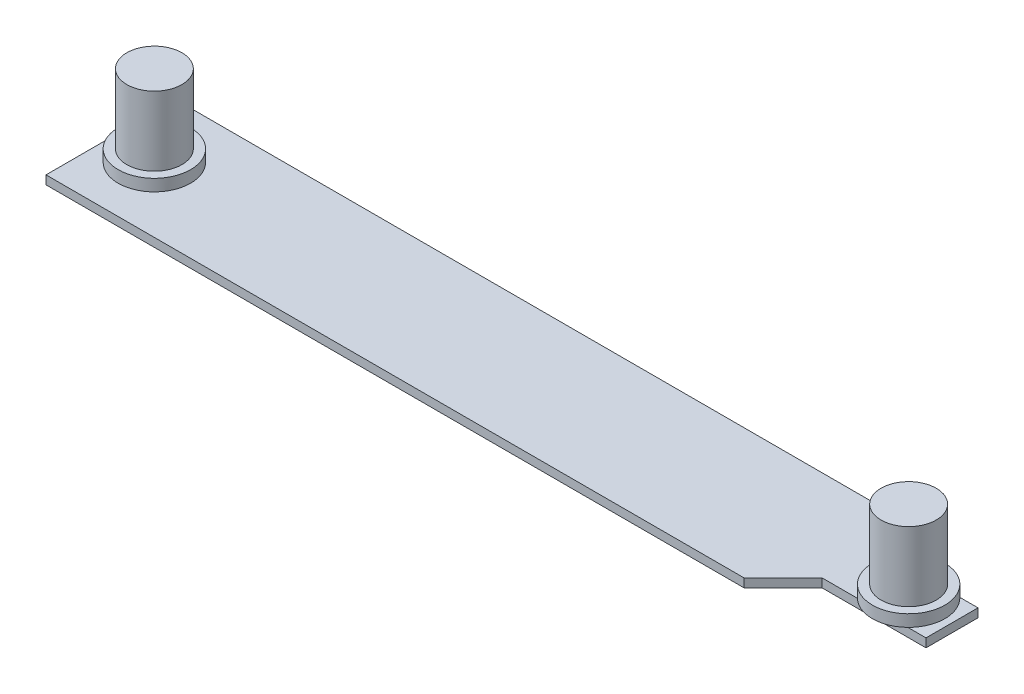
from build123d import *

# Parameters (mm, degrees)
BOSS_EXTRUDE1_DEPTH = 1
SKETCH4_R           = 4.18
BOSS_EXTRUDE2_DEPTH = 1.36
SKETCH5_R           = 3.18
BOSS_EXTRUDE3_DEPTH = 8


with BuildPart() as part:
    # Sketch1 → Boss-Extrude1 (new body)
    with BuildSketch(Plane(origin=(0, 0, 0), x_dir=(1, 0, 0), z_dir=(0, 1, 0))):
        Polygon((48.5, 3), (36.5, 3), (32, 7.5), (-48.5, 7.5), (-48.5, -7.5), (32, -7.5), (36.5, -3), (48.5, -3), align=None)
    extrude(amount=BOSS_EXTRUDE1_DEPTH)

    # Sketch4 → Boss-Extrude2 (add)
    with BuildSketch(Plane(origin=(0, 1, 0), x_dir=(1, 0, 0), z_dir=(0, 1, 0))):
        with Locations(Location((-43.5, 0, 0), (0, 0, 90))):
            Circle(SKETCH4_R)
        with Locations(Location((43.5, 0, 0), (0, 0, 45.865188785))):
            Circle(SKETCH4_R)
    extrude(amount=BOSS_EXTRUDE2_DEPTH)

    # Sketch5 → Boss-Extrude3 (add)
    with BuildSketch(Plane(origin=(0, 2.36, 0), x_dir=(1, 0, 0), z_dir=(0, 1, 0))):
        with Locations(Location((-43.5, 0, 0), (0, 0, 270))):
            Circle(SKETCH5_R)
        with Locations(Location((43.5, 0, 0), (0, 0, 270))):
            Circle(SKETCH5_R)
    extrude(amount=BOSS_EXTRUDE3_DEPTH)


solid = part.part
